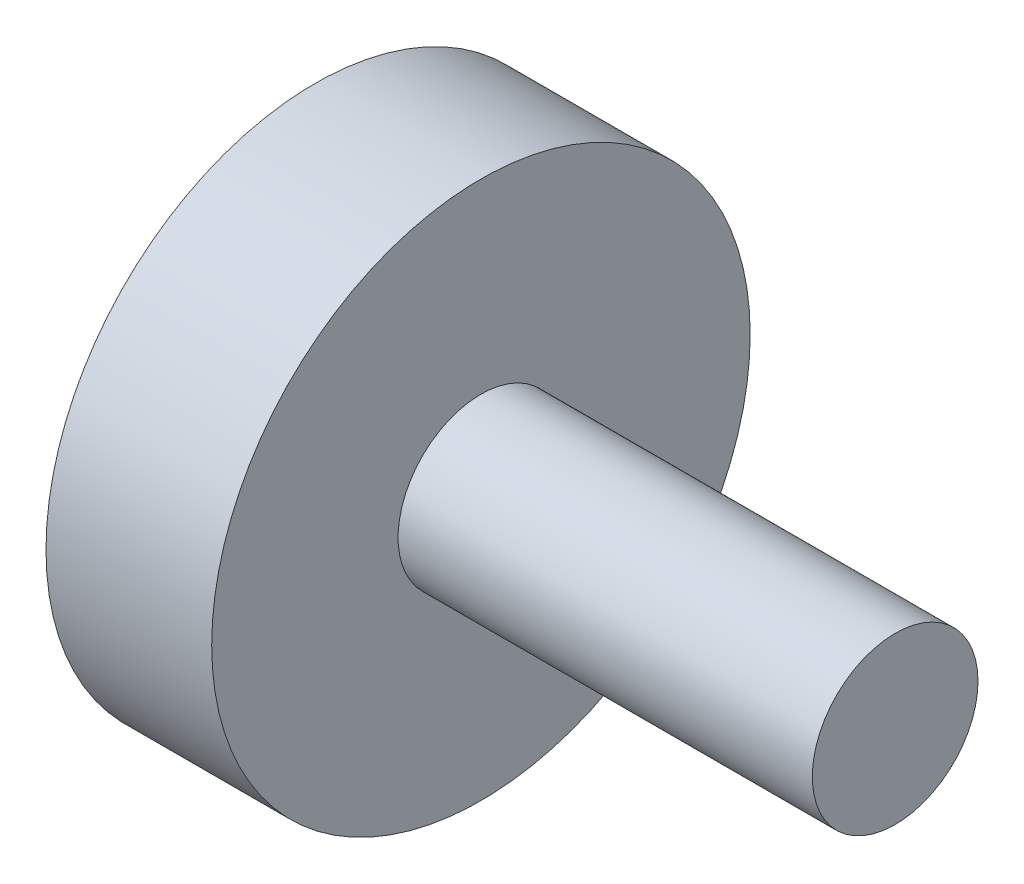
from build123d import *


with BuildPart() as part:
    # Esquisse1 → R_volution1 (revolve)
    with BuildSketch(Plane.XY, mode=Mode.PRIVATE) as r_volution1_sk:
        Polygon((24, 4.3), (26, 4.3), (26, 6.55), (31, 6.55), (31, 7.55), (23, 7.55), (23, 7.05), (24, 7.05), align=None)
    revolve(r_volution1_sk.sketch.rotate(Axis((26, 7.55, 0), (-1, 0, 0)), 270), axis=Axis((26, 7.55, 0), (-1, 0, 0)))


solid = part.part
